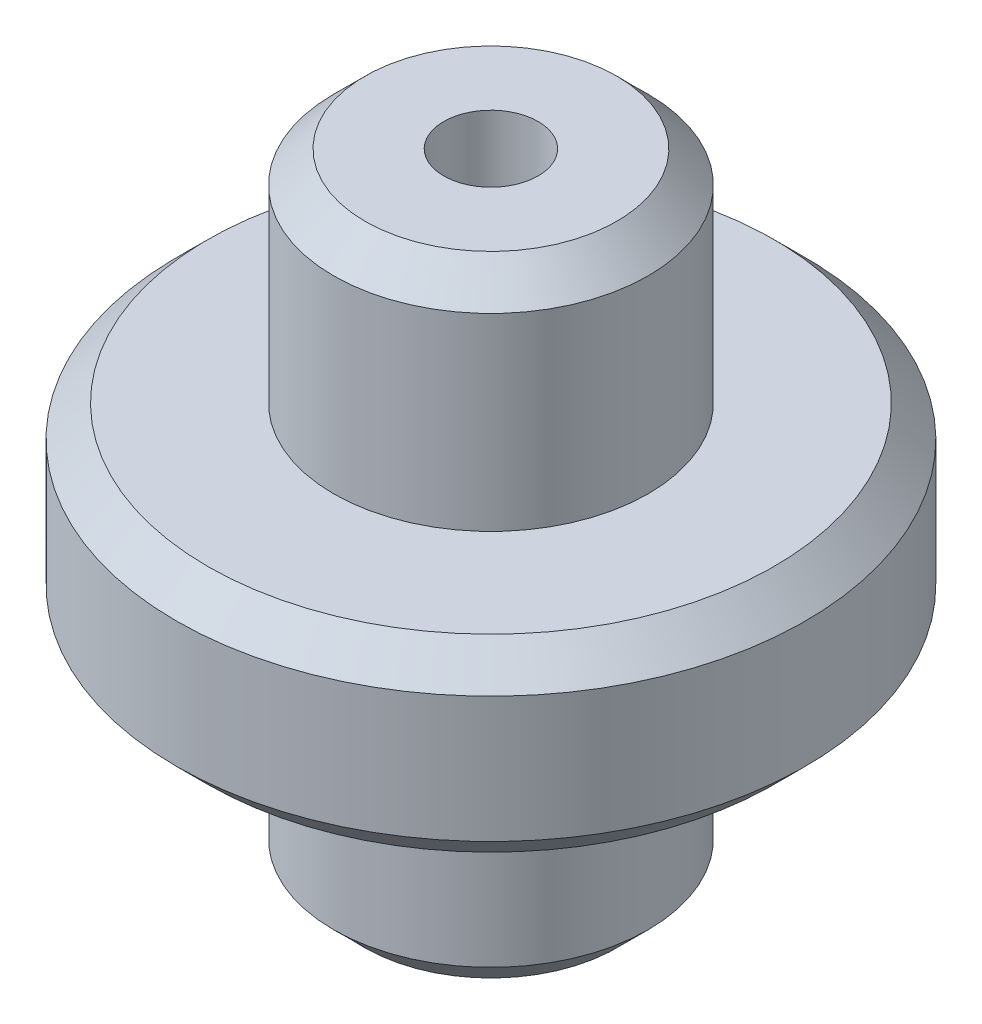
ISO-10303-21;
HEADER;
FILE_DESCRIPTION(('STEP AP214'),'2;1');
FILE_NAME('part.step','',(''),(''),'','','');
FILE_SCHEMA(('AUTOMOTIVE_DESIGN { 1 0 10303 214 1 1 1 1 }'));
ENDSEC;
DATA;
#1=APPLICATION_CONTEXT('core data for automotive mechanical design processes');
#2=APPLICATION_PROTOCOL_DEFINITION('international standard','automotive_design',2000,#1);
#3=PRODUCT_CONTEXT('',#1,'mechanical');
#4=PRODUCT('Part','Part','',(#3));
#5=PRODUCT_RELATED_PRODUCT_CATEGORY('part','',(#4));
#6=PRODUCT_DEFINITION_FORMATION('','',#4);
#7=PRODUCT_DEFINITION_CONTEXT('part definition',#1,'design');
#8=PRODUCT_DEFINITION('design','',#6,#7);
#9=PRODUCT_DEFINITION_SHAPE('','',#8);
#10=(LENGTH_UNIT() NAMED_UNIT(*) SI_UNIT(.MILLI.,.METRE.));
#11=(NAMED_UNIT(*) PLANE_ANGLE_UNIT() SI_UNIT($,.RADIAN.));
#12=(NAMED_UNIT(*) SI_UNIT($,.STERADIAN.) SOLID_ANGLE_UNIT());
#13=UNCERTAINTY_MEASURE_WITH_UNIT(LENGTH_MEASURE(1.E-05),#10,'distance_accuracy_value','');
#14=(GEOMETRIC_REPRESENTATION_CONTEXT(3) GLOBAL_UNCERTAINTY_ASSIGNED_CONTEXT((#13)) GLOBAL_UNIT_ASSIGNED_CONTEXT((#10,
#11,#12)) REPRESENTATION_CONTEXT('',''));
#15=CARTESIAN_POINT('',(0.,0.,0.));
#16=DIRECTION('',(0.,0.,1.));
#17=DIRECTION('',(1.,0.,0.));
#18=AXIS2_PLACEMENT_3D('',#15,#16,#17);
#19=CARTESIAN_POINT('',(0.,0.,0.));
#20=DIRECTION('',(0.,1.,0.));
#21=DIRECTION('',(0.,0.,1.));
#22=AXIS2_PLACEMENT_3D('',#19,#20,#21);
#23=PLANE('',#22);
#24=CARTESIAN_POINT('',(0.,0.,0.));
#25=DIRECTION('',(0.,1.,0.));
#26=DIRECTION('',(0.,0.,1.));
#27=AXIS2_PLACEMENT_3D('',#24,#25,#26);
#28=CIRCLE('',#27,9.);
#29=CARTESIAN_POINT('',(0.,0.,9.));
#30=VERTEX_POINT('',#29);
#31=EDGE_CURVE('E41',#30,#30,#28,.F.);
#32=ORIENTED_EDGE('',*,*,#31,.T.);
#33=EDGE_LOOP('',(#32));
#34=FACE_BOUND('',#33,.T.);
#35=CARTESIAN_POINT('',(0.,0.,0.));
#36=DIRECTION('',(0.,1.,0.));
#37=DIRECTION('',(0.,0.,1.));
#38=AXIS2_PLACEMENT_3D('',#35,#36,#37);
#39=CIRCLE('',#38,5.);
#40=CARTESIAN_POINT('',(0.,0.,5.));
#41=VERTEX_POINT('',#40);
#42=EDGE_CURVE('E62',#41,#41,#39,.F.);
#43=ORIENTED_EDGE('',*,*,#42,.F.);
#44=EDGE_LOOP('',(#43));
#45=FACE_BOUND('',#44,.T.);
#46=ADVANCED_FACE('F30',(#34,#45),#23,.F.);
#47=CARTESIAN_POINT('',(0.,6.,0.));
#48=DIRECTION('',(0.,1.,0.));
#49=DIRECTION('',(0.,0.,1.));
#50=AXIS2_PLACEMENT_3D('',#47,#48,#49);
#51=PLANE('',#50);
#52=CARTESIAN_POINT('',(0.,6.,0.));
#53=DIRECTION('',(0.,1.,0.));
#54=DIRECTION('',(0.,0.,1.));
#55=AXIS2_PLACEMENT_3D('',#52,#53,#54);
#56=CIRCLE('',#55,9.00000000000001);
#57=CARTESIAN_POINT('',(0.,6.,9.00000000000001));
#58=VERTEX_POINT('',#57);
#59=EDGE_CURVE('E53',#58,#58,#56,.T.);
#60=ORIENTED_EDGE('',*,*,#59,.T.);
#61=EDGE_LOOP('',(#60));
#62=FACE_BOUND('',#61,.T.);
#63=CARTESIAN_POINT('',(0.,6.,0.));
#64=DIRECTION('',(0.,1.,0.));
#65=DIRECTION('',(0.,0.,1.));
#66=AXIS2_PLACEMENT_3D('',#63,#64,#65);
#67=CIRCLE('',#66,5.);
#68=CARTESIAN_POINT('',(0.,6.,5.));
#69=VERTEX_POINT('',#68);
#70=EDGE_CURVE('E65',#69,#69,#67,.T.);
#71=ORIENTED_EDGE('',*,*,#70,.F.);
#72=EDGE_LOOP('',(#71));
#73=FACE_BOUND('',#72,.T.);
#74=ADVANCED_FACE('F91',(#62,#73),#51,.T.);
#75=CARTESIAN_POINT('',(0.,6.,0.));
#76=DIRECTION('',(0.,-1.,0.));
#77=DIRECTION('',(0.,0.,-1.));
#78=AXIS2_PLACEMENT_3D('',#75,#76,#77);
#79=CYLINDRICAL_SURFACE('',#78,10.);
#80=CARTESIAN_POINT('',(0.,5.,0.));
#81=DIRECTION('',(0.,1.,0.));
#82=DIRECTION('',(0.,0.,1.));
#83=AXIS2_PLACEMENT_3D('',#80,#81,#82);
#84=CIRCLE('',#83,10.);
#85=CARTESIAN_POINT('',(0.,5.,10.));
#86=VERTEX_POINT('',#85);
#87=EDGE_CURVE('E45',#86,#86,#84,.F.);
#88=ORIENTED_EDGE('',*,*,#87,.T.);
#89=EDGE_LOOP('',(#88));
#90=FACE_BOUND('',#89,.T.);
#91=CARTESIAN_POINT('',(0.,1.,0.));
#92=DIRECTION('',(0.,1.,0.));
#93=DIRECTION('',(0.,0.,1.));
#94=AXIS2_PLACEMENT_3D('',#91,#92,#93);
#95=CIRCLE('',#94,10.);
#96=CARTESIAN_POINT('',(0.,1.,10.));
#97=VERTEX_POINT('',#96);
#98=EDGE_CURVE('E50',#97,#97,#95,.T.);
#99=ORIENTED_EDGE('',*,*,#98,.T.);
#100=EDGE_LOOP('',(#99));
#101=FACE_BOUND('',#100,.T.);
#102=ADVANCED_FACE('F32',(#90,#101),#79,.T.);
#103=CARTESIAN_POINT('',(0.,13.,0.));
#104=DIRECTION('',(0.,-1.,0.));
#105=DIRECTION('',(0.,0.,-1.));
#106=AXIS2_PLACEMENT_3D('',#103,#104,#105);
#107=CYLINDRICAL_SURFACE('',#106,5.);
#108=CARTESIAN_POINT('',(0.,12.,0.));
#109=DIRECTION('',(0.,1.,0.));
#110=DIRECTION('',(0.,0.,1.));
#111=AXIS2_PLACEMENT_3D('',#108,#109,#110);
#112=CIRCLE('',#111,5.);
#113=CARTESIAN_POINT('',(0.,12.,5.));
#114=VERTEX_POINT('',#113);
#115=EDGE_CURVE('E56',#114,#114,#112,.F.);
#116=ORIENTED_EDGE('',*,*,#115,.T.);
#117=EDGE_LOOP('',(#116));
#118=FACE_BOUND('',#117,.T.);
#119=ORIENTED_EDGE('',*,*,#70,.T.);
#120=EDGE_LOOP('',(#119));
#121=FACE_BOUND('',#120,.T.);
#122=ADVANCED_FACE('F100',(#118,#121),#107,.T.);
#123=CARTESIAN_POINT('',(0.,13.,0.));
#124=DIRECTION('',(0.,1.,0.));
#125=DIRECTION('',(0.,0.,1.));
#126=AXIS2_PLACEMENT_3D('',#123,#124,#125);
#127=PLANE('',#126);
#128=CARTESIAN_POINT('',(0.,13.,0.));
#129=DIRECTION('',(0.,1.,0.));
#130=DIRECTION('',(0.,0.,1.));
#131=AXIS2_PLACEMENT_3D('',#128,#129,#130);
#132=CIRCLE('',#131,4.);
#133=CARTESIAN_POINT('',(0.,13.,4.));
#134=VERTEX_POINT('',#133);
#135=EDGE_CURVE('E59',#134,#134,#132,.T.);
#136=ORIENTED_EDGE('',*,*,#135,.T.);
#137=EDGE_LOOP('',(#136));
#138=FACE_BOUND('',#137,.T.);
#139=CARTESIAN_POINT('',(0.,13.,0.));
#140=DIRECTION('',(0.,-1.,0.));
#141=DIRECTION('',(0.,0.,-1.));
#142=AXIS2_PLACEMENT_3D('',#139,#140,#141);
#143=CIRCLE('',#142,1.5);
#144=CARTESIAN_POINT('',(0.,13.,-1.5));
#145=VERTEX_POINT('',#144);
#146=EDGE_CURVE('E68',#145,#145,#143,.T.);
#147=ORIENTED_EDGE('',*,*,#146,.T.);
#148=EDGE_LOOP('',(#147));
#149=FACE_BOUND('',#148,.T.);
#150=ADVANCED_FACE('F88',(#138,#149),#127,.T.);
#151=CARTESIAN_POINT('',(0.,-7.,0.));
#152=DIRECTION('',(0.,1.,0.));
#153=DIRECTION('',(0.,0.,1.));
#154=AXIS2_PLACEMENT_3D('',#151,#152,#153);
#155=CYLINDRICAL_SURFACE('',#154,5.);
#156=CARTESIAN_POINT('',(0.,-6.,0.));
#157=DIRECTION('',(0.,-1.,0.));
#158=DIRECTION('',(0.,0.,-1.));
#159=AXIS2_PLACEMENT_3D('',#156,#157,#158);
#160=CIRCLE('',#159,5.);
#161=CARTESIAN_POINT('',(0.,-6.,-5.));
#162=VERTEX_POINT('',#161);
#163=EDGE_CURVE('E10',#162,#162,#160,.F.);
#164=ORIENTED_EDGE('',*,*,#163,.T.);
#165=EDGE_LOOP('',(#164));
#166=FACE_BOUND('',#165,.T.);
#167=ORIENTED_EDGE('',*,*,#42,.T.);
#168=EDGE_LOOP('',(#167));
#169=FACE_BOUND('',#168,.T.);
#170=ADVANCED_FACE('F79',(#166,#169),#155,.T.);
#171=CARTESIAN_POINT('',(0.,-7.,0.));
#172=DIRECTION('',(0.,-1.,0.));
#173=DIRECTION('',(0.,0.,-1.));
#174=AXIS2_PLACEMENT_3D('',#171,#172,#173);
#175=PLANE('',#174);
#176=CARTESIAN_POINT('',(0.,-7.,0.));
#177=DIRECTION('',(0.,-1.,0.));
#178=DIRECTION('',(0.,0.,-1.));
#179=AXIS2_PLACEMENT_3D('',#176,#177,#178);
#180=CIRCLE('',#179,4.);
#181=CARTESIAN_POINT('',(0.,-7.,-4.));
#182=VERTEX_POINT('',#181);
#183=EDGE_CURVE('E37',#182,#182,#180,.T.);
#184=ORIENTED_EDGE('',*,*,#183,.T.);
#185=EDGE_LOOP('',(#184));
#186=FACE_BOUND('',#185,.T.);
#187=CARTESIAN_POINT('',(0.,-7.,0.));
#188=DIRECTION('',(0.,-1.,0.));
#189=DIRECTION('',(0.,0.,-1.));
#190=AXIS2_PLACEMENT_3D('',#187,#188,#189);
#191=CIRCLE('',#190,1.5);
#192=CARTESIAN_POINT('',(0.,-7.,-1.5));
#193=VERTEX_POINT('',#192);
#194=EDGE_CURVE('E71',#193,#193,#191,.T.);
#195=ORIENTED_EDGE('',*,*,#194,.F.);
#196=EDGE_LOOP('',(#195));
#197=FACE_BOUND('',#196,.T.);
#198=ADVANCED_FACE('F77',(#186,#197),#175,.T.);
#199=CARTESIAN_POINT('',(0.,13.,0.));
#200=DIRECTION('',(0.,-1.,0.));
#201=DIRECTION('',(0.,0.,-1.));
#202=AXIS2_PLACEMENT_3D('',#199,#200,#201);
#203=CYLINDRICAL_SURFACE('',#202,1.5);
#204=ORIENTED_EDGE('',*,*,#146,.F.);
#205=EDGE_LOOP('',(#204));
#206=FACE_BOUND('',#205,.T.);
#207=ORIENTED_EDGE('',*,*,#194,.T.);
#208=EDGE_LOOP('',(#207));
#209=FACE_BOUND('',#208,.T.);
#210=ADVANCED_FACE('F75',(#206,#209),#203,.F.);
#211=CARTESIAN_POINT('',(0.,13.,0.));
#212=DIRECTION('',(0.,-1.,0.));
#213=DIRECTION('',(0.,0.,-1.));
#214=AXIS2_PLACEMENT_3D('',#211,#212,#213);
#215=CONICAL_SURFACE('',#214,4.,0.785398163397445);
#216=ORIENTED_EDGE('',*,*,#115,.F.);
#217=EDGE_LOOP('',(#216));
#218=FACE_BOUND('',#217,.T.);
#219=ORIENTED_EDGE('',*,*,#135,.F.);
#220=EDGE_LOOP('',(#219));
#221=FACE_BOUND('',#220,.T.);
#222=ADVANCED_FACE('F85',(#218,#221),#215,.T.);
#223=CARTESIAN_POINT('',(0.,6.,0.));
#224=DIRECTION('',(0.,-1.,0.));
#225=DIRECTION('',(0.,0.,-1.));
#226=AXIS2_PLACEMENT_3D('',#223,#224,#225);
#227=CONICAL_SURFACE('',#226,9.00000000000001,0.785398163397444);
#228=ORIENTED_EDGE('',*,*,#87,.F.);
#229=EDGE_LOOP('',(#228));
#230=FACE_BOUND('',#229,.T.);
#231=ORIENTED_EDGE('',*,*,#59,.F.);
#232=EDGE_LOOP('',(#231));
#233=FACE_BOUND('',#232,.T.);
#234=ADVANCED_FACE('F113',(#230,#233),#227,.T.);
#235=CARTESIAN_POINT('',(0.,1.,0.));
#236=DIRECTION('',(0.,1.,0.));
#237=DIRECTION('',(0.,0.,1.));
#238=AXIS2_PLACEMENT_3D('',#235,#236,#237);
#239=CONICAL_SURFACE('',#238,10.,0.78539816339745);
#240=ORIENTED_EDGE('',*,*,#31,.F.);
#241=EDGE_LOOP('',(#240));
#242=FACE_BOUND('',#241,.T.);
#243=ORIENTED_EDGE('',*,*,#98,.F.);
#244=EDGE_LOOP('',(#243));
#245=FACE_BOUND('',#244,.T.);
#246=ADVANCED_FACE('F119',(#242,#245),#239,.T.);
#247=CARTESIAN_POINT('',(0.,-7.,0.));
#248=DIRECTION('',(0.,1.,0.));
#249=DIRECTION('',(0.,0.,1.));
#250=AXIS2_PLACEMENT_3D('',#247,#248,#249);
#251=CONICAL_SURFACE('',#250,4.,0.785398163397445);
#252=ORIENTED_EDGE('',*,*,#163,.F.);
#253=EDGE_LOOP('',(#252));
#254=FACE_BOUND('',#253,.T.);
#255=ORIENTED_EDGE('',*,*,#183,.F.);
#256=EDGE_LOOP('',(#255));
#257=FACE_BOUND('',#256,.T.);
#258=ADVANCED_FACE('F126',(#254,#257),#251,.T.);
#259=CLOSED_SHELL('',(#46,#74,#102,#122,#150,#170,#198,#210,#222,#234,#246,#258));
#260=MANIFOLD_SOLID_BREP('B2',#259);
#261=ADVANCED_BREP_SHAPE_REPRESENTATION('',(#18,#260),#14);
#262=SHAPE_DEFINITION_REPRESENTATION(#9,#261);
ENDSEC;
END-ISO-10303-21;
